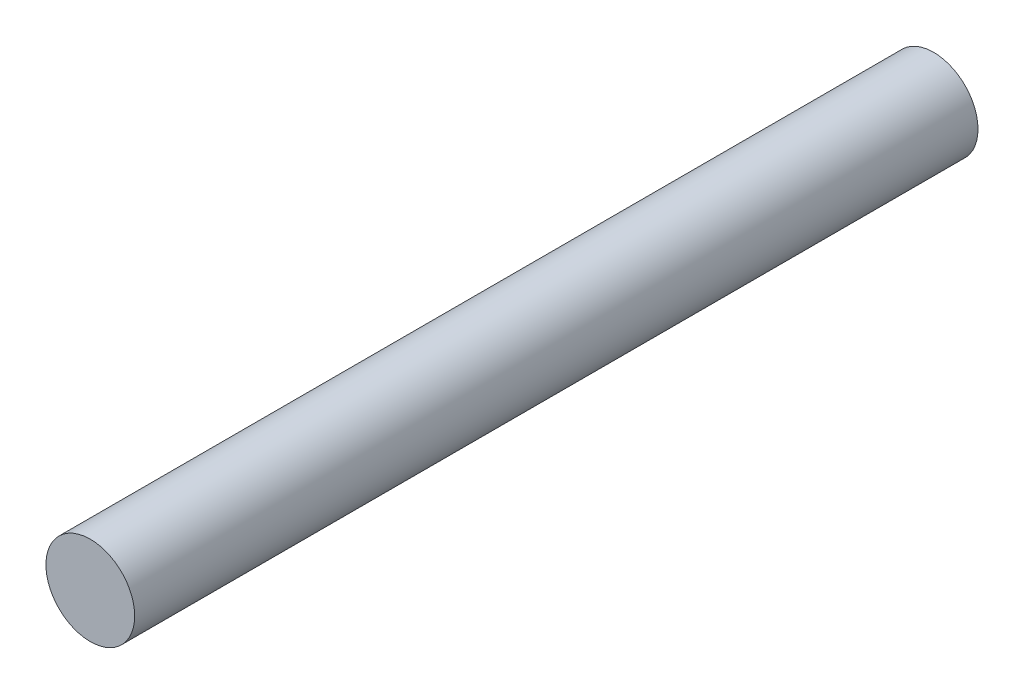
ISO-10303-21;
HEADER;
FILE_DESCRIPTION(('STEP AP214'),'2;1');
FILE_NAME('part.step','',(''),(''),'','','');
FILE_SCHEMA(('AUTOMOTIVE_DESIGN { 1 0 10303 214 1 1 1 1 }'));
ENDSEC;
DATA;
#1=APPLICATION_CONTEXT('core data for automotive mechanical design processes');
#2=APPLICATION_PROTOCOL_DEFINITION('international standard','automotive_design',2000,#1);
#3=PRODUCT_CONTEXT('',#1,'mechanical');
#4=PRODUCT('Part','Part','',(#3));
#5=PRODUCT_RELATED_PRODUCT_CATEGORY('part','',(#4));
#6=PRODUCT_DEFINITION_FORMATION('','',#4);
#7=PRODUCT_DEFINITION_CONTEXT('part definition',#1,'design');
#8=PRODUCT_DEFINITION('design','',#6,#7);
#9=PRODUCT_DEFINITION_SHAPE('','',#8);
#10=(LENGTH_UNIT() NAMED_UNIT(*) SI_UNIT(.MILLI.,.METRE.));
#11=(NAMED_UNIT(*) PLANE_ANGLE_UNIT() SI_UNIT($,.RADIAN.));
#12=(NAMED_UNIT(*) SI_UNIT($,.STERADIAN.) SOLID_ANGLE_UNIT());
#13=UNCERTAINTY_MEASURE_WITH_UNIT(LENGTH_MEASURE(1.E-05),#10,'distance_accuracy_value','');
#14=(GEOMETRIC_REPRESENTATION_CONTEXT(3) GLOBAL_UNCERTAINTY_ASSIGNED_CONTEXT((#13)) GLOBAL_UNIT_ASSIGNED_CONTEXT((#10,
#11,#12)) REPRESENTATION_CONTEXT('',''));
#15=CARTESIAN_POINT('',(0.,0.,0.));
#16=DIRECTION('',(0.,0.,1.));
#17=DIRECTION('',(1.,0.,0.));
#18=AXIS2_PLACEMENT_3D('',#15,#16,#17);
#19=CARTESIAN_POINT('',(0.,0.,19.));
#20=DIRECTION('',(0.,0.,-1.));
#21=DIRECTION('',(-1.,0.,0.));
#22=AXIS2_PLACEMENT_3D('',#19,#20,#21);
#23=CYLINDRICAL_SURFACE('',#22,1.);
#24=CARTESIAN_POINT('',(0.,0.,19.));
#25=DIRECTION('',(0.,0.,1.));
#26=DIRECTION('',(1.,0.,0.));
#27=AXIS2_PLACEMENT_3D('',#24,#25,#26);
#28=CIRCLE('',#27,1.);
#29=CARTESIAN_POINT('',(1.,0.,19.));
#30=VERTEX_POINT('',#29);
#31=EDGE_CURVE('E10',#30,#30,#28,.T.);
#32=ORIENTED_EDGE('',*,*,#31,.F.);
#33=EDGE_LOOP('',(#32));
#34=FACE_BOUND('',#33,.T.);
#35=CARTESIAN_POINT('',(0.,0.,0.));
#36=DIRECTION('',(0.,0.,1.));
#37=DIRECTION('',(1.,0.,0.));
#38=AXIS2_PLACEMENT_3D('',#35,#36,#37);
#39=CIRCLE('',#38,1.);
#40=CARTESIAN_POINT('',(1.,0.,0.));
#41=VERTEX_POINT('',#40);
#42=EDGE_CURVE('E30',#41,#41,#39,.T.);
#43=ORIENTED_EDGE('',*,*,#42,.T.);
#44=EDGE_LOOP('',(#43));
#45=FACE_BOUND('',#44,.T.);
#46=ADVANCED_FACE('F24',(#34,#45),#23,.T.);
#47=CARTESIAN_POINT('',(0.,0.,19.));
#48=DIRECTION('',(0.,0.,1.));
#49=DIRECTION('',(1.,0.,0.));
#50=AXIS2_PLACEMENT_3D('',#47,#48,#49);
#51=PLANE('',#50);
#52=ORIENTED_EDGE('',*,*,#31,.T.);
#53=EDGE_LOOP('',(#52));
#54=FACE_BOUND('',#53,.T.);
#55=ADVANCED_FACE('F39',(#54),#51,.T.);
#56=CARTESIAN_POINT('',(0.,0.,0.));
#57=DIRECTION('',(0.,0.,1.));
#58=DIRECTION('',(1.,0.,0.));
#59=AXIS2_PLACEMENT_3D('',#56,#57,#58);
#60=PLANE('',#59);
#61=ORIENTED_EDGE('',*,*,#42,.F.);
#62=EDGE_LOOP('',(#61));
#63=FACE_BOUND('',#62,.T.);
#64=ADVANCED_FACE('F37',(#63),#60,.F.);
#65=CLOSED_SHELL('',(#46,#55,#64));
#66=MANIFOLD_SOLID_BREP('B2',#65);
#67=ADVANCED_BREP_SHAPE_REPRESENTATION('',(#18,#66),#14);
#68=SHAPE_DEFINITION_REPRESENTATION(#9,#67);
ENDSEC;
END-ISO-10303-21;
